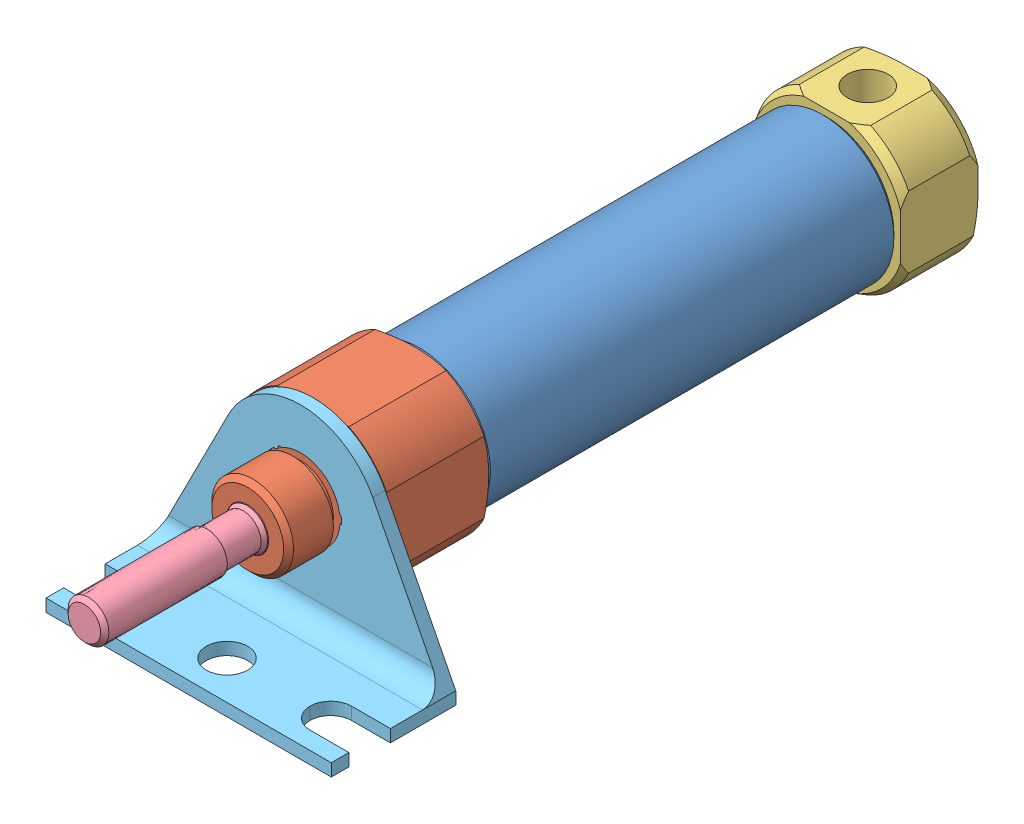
SolidWorks assembly ncj22005z-mp.sldasm, configuration Default (file format 3100). Lengths in mm.
Overall size (34.92 23.88 100.4).
5 component instances, 5 part files, 15 mates.
Components (placement in the parent):
- NCJ2Tubes-1: NCJ2Tubes.SLDPRT [16] at origin size (17.4 17.4 50.4)
- NCJ2RodCover-1: NCJ2RodCover.SLDPRT [16] at (0 0 25.2) size (18 18 20.5)
- NCJ2HeadCover-1: NCJ2HeadCover.SLDPRT [16] at (0 0 -34.7) size (18 18 9.5)
- NCJ2Rods-1: NCJ2Rods.SLDPRT [16] at (0 0 -12.7) size (15.5 15.5 80.9)
- pneumatic-cylinder-bracket-1: pneumatic-cylinder-bracket.SLDPRT [Default] at (0 -13.97 37.7) size (34.92 23.88 15.24)
Mates (geometry in assembly coordinates):
- Parallel1: parallel aligned: plane of NCJ2RodCover-1; plane of ?
- Concentric2: concentric aligned: cylinder of NCJ2Tubes-1; cylinder of NCJ2HeadCover-1
- Parallel2: parallel aligned: plane of NCJ2HeadCover-1; plane of ?
- Coincident1: coincident anti-aligned: plane of NCJ2Tubes-1; plane of NCJ2RodCover-1
- Coincident2: coincident anti-aligned: plane of NCJ2Tubes-1; plane of NCJ2HeadCover-1
- Concentric9: concentric aligned: cylinder of NCJ2Tubes-1; cylinder of NCJ2Rods-1
- Stroke Distance: distance = 0 mm anti-aligned: plane of NCJ2Tubes-1; plane of NCJ2Rods-1
- Parallel9: parallel aligned: plane of NCJ2Rods-1; plane of ?
- Concentric11: concentric aligned: cylinder of NCJ2Tubes-1; cylinder of NCJ2RodCover-1
- Distance13: distance = 0 mm anti-aligned: plane of NCJ2RodCover-1; plane of ?
- Concentric18: concentric anti-aligned: cylinder of NCJ2Tubes-1; cylinder of ?
- Parallel14: parallel aligned: plane of NCJ2RodCover-1; plane of ?
- Concentric19: concentric aligned: cylinder of NCJ2RodCover-1; cylinder of ?
- Coincident3: coincident anti-aligned: plane of NCJ2RodCover-1; plane of ?
- Parallel15: parallel = 58.97 mm aligned: plane of NCJ2RodCover-1; plane of ?; axis of ?
